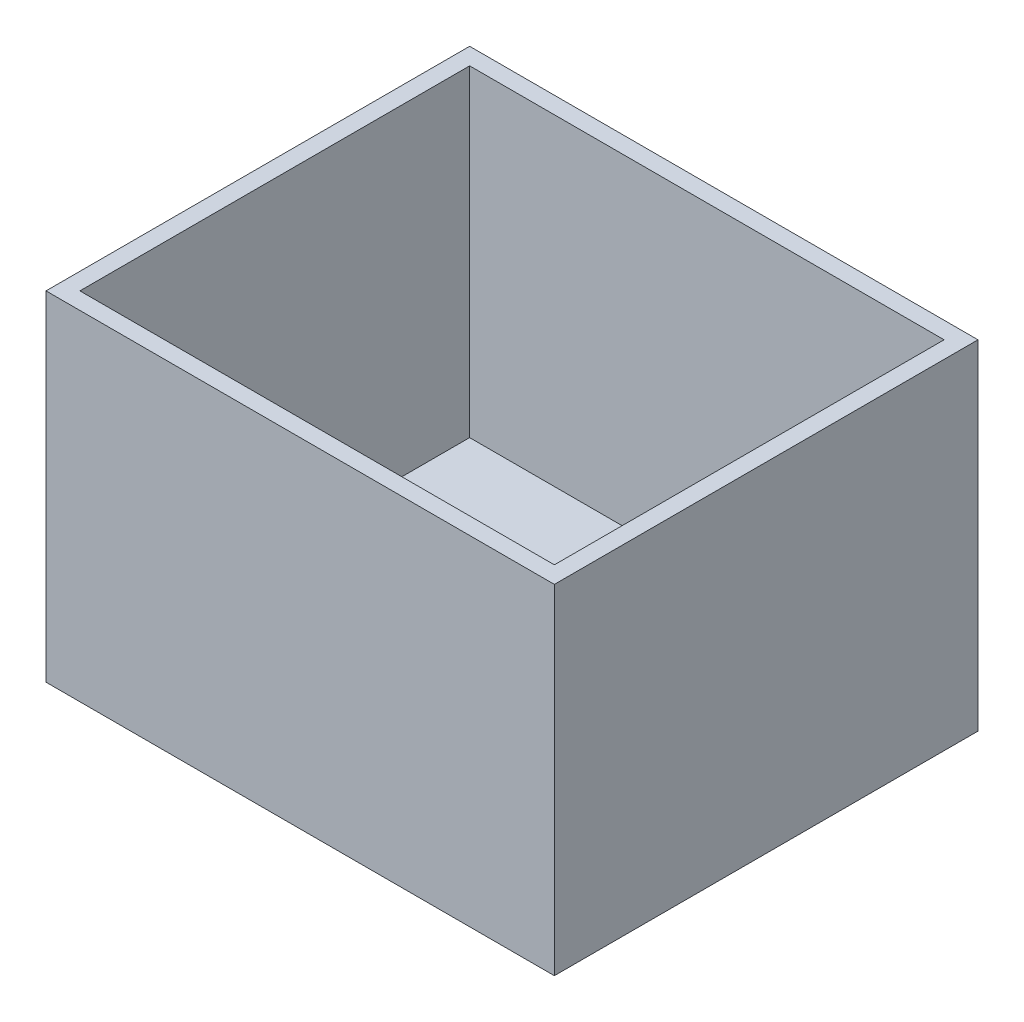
ISO-10303-21;
HEADER;
FILE_DESCRIPTION(('STEP AP214'),'2;1');
FILE_NAME('part.step','',(''),(''),'','','');
FILE_SCHEMA(('AUTOMOTIVE_DESIGN { 1 0 10303 214 1 1 1 1 }'));
ENDSEC;
DATA;
#1=APPLICATION_CONTEXT('core data for automotive mechanical design processes');
#2=APPLICATION_PROTOCOL_DEFINITION('international standard','automotive_design',2000,#1);
#3=PRODUCT_CONTEXT('',#1,'mechanical');
#4=PRODUCT('Part','Part','',(#3));
#5=PRODUCT_RELATED_PRODUCT_CATEGORY('part','',(#4));
#6=PRODUCT_DEFINITION_FORMATION('','',#4);
#7=PRODUCT_DEFINITION_CONTEXT('part definition',#1,'design');
#8=PRODUCT_DEFINITION('design','',#6,#7);
#9=PRODUCT_DEFINITION_SHAPE('','',#8);
#10=(LENGTH_UNIT() NAMED_UNIT(*) SI_UNIT(.MILLI.,.METRE.));
#11=(NAMED_UNIT(*) PLANE_ANGLE_UNIT() SI_UNIT($,.RADIAN.));
#12=(NAMED_UNIT(*) SI_UNIT($,.STERADIAN.) SOLID_ANGLE_UNIT());
#13=UNCERTAINTY_MEASURE_WITH_UNIT(LENGTH_MEASURE(1.E-05),#10,'distance_accuracy_value','');
#14=(GEOMETRIC_REPRESENTATION_CONTEXT(3) GLOBAL_UNCERTAINTY_ASSIGNED_CONTEXT((#13)) GLOBAL_UNIT_ASSIGNED_CONTEXT((#10,
#11,#12)) REPRESENTATION_CONTEXT('',''));
#15=CARTESIAN_POINT('',(0.,0.,0.));
#16=DIRECTION('',(0.,0.,1.));
#17=DIRECTION('',(1.,0.,0.));
#18=AXIS2_PLACEMENT_3D('',#15,#16,#17);
#19=CARTESIAN_POINT('',(0.,0.,25.));
#20=DIRECTION('',(0.,1.,0.));
#21=DIRECTION('',(0.,0.,1.));
#22=AXIS2_PLACEMENT_3D('',#19,#20,#21);
#23=PLANE('',#22);
#24=DIRECTION('',(1.,0.,0.));
#25=VECTOR('',#24,1.);
#26=CARTESIAN_POINT('',(0.,0.,-25.));
#27=LINE('',#26,#25);
#28=CARTESIAN_POINT('',(0.,0.,-25.));
#29=VERTEX_POINT('',#28);
#30=CARTESIAN_POINT('',(60.,0.,-25.));
#31=VERTEX_POINT('',#30);
#32=EDGE_CURVE('E164',#29,#31,#27,.T.);
#33=ORIENTED_EDGE('',*,*,#32,.T.);
#34=DIRECTION('',(0.,0.,-1.));
#35=VECTOR('',#34,1.);
#36=CARTESIAN_POINT('',(60.,0.,25.));
#37=LINE('',#36,#35);
#38=CARTESIAN_POINT('',(60.,0.,25.));
#39=VERTEX_POINT('',#38);
#40=EDGE_CURVE('E172',#39,#31,#37,.T.);
#41=ORIENTED_EDGE('',*,*,#40,.F.);
#42=DIRECTION('',(1.,0.,0.));
#43=VECTOR('',#42,1.);
#44=CARTESIAN_POINT('',(0.,0.,25.));
#45=LINE('',#44,#43);
#46=CARTESIAN_POINT('',(0.,0.,25.));
#47=VERTEX_POINT('',#46);
#48=EDGE_CURVE('E94',#47,#39,#45,.T.);
#49=ORIENTED_EDGE('',*,*,#48,.F.);
#50=DIRECTION('',(0.,0.,-1.));
#51=VECTOR('',#50,1.);
#52=CARTESIAN_POINT('',(0.,0.,25.));
#53=LINE('',#52,#51);
#54=EDGE_CURVE('E175',#47,#29,#53,.T.);
#55=ORIENTED_EDGE('',*,*,#54,.T.);
#56=EDGE_LOOP('',(#33,#41,#49,#55));
#57=FACE_BOUND('',#56,.T.);
#58=CARTESIAN_POINT('',(6.,0.,18.));
#59=DIRECTION('',(0.,1.,0.));
#60=DIRECTION('',(0.,0.,1.));
#61=AXIS2_PLACEMENT_3D('',#58,#59,#60);
#62=CIRCLE('',#61,2.5);
#63=CARTESIAN_POINT('',(6.,0.,20.5));
#64=VERTEX_POINT('',#63);
#65=EDGE_CURVE('E177',#64,#64,#62,.F.);
#66=ORIENTED_EDGE('',*,*,#65,.F.);
#67=EDGE_LOOP('',(#66));
#68=FACE_BOUND('',#67,.T.);
#69=CARTESIAN_POINT('',(6.,0.,-18.));
#70=DIRECTION('',(0.,1.,0.));
#71=DIRECTION('',(0.,0.,1.));
#72=AXIS2_PLACEMENT_3D('',#69,#70,#71);
#73=CIRCLE('',#72,2.5);
#74=CARTESIAN_POINT('',(6.,0.,-15.5));
#75=VERTEX_POINT('',#74);
#76=EDGE_CURVE('E49',#75,#75,#73,.F.);
#77=ORIENTED_EDGE('',*,*,#76,.F.);
#78=EDGE_LOOP('',(#77));
#79=FACE_BOUND('',#78,.T.);
#80=CARTESIAN_POINT('',(55.,0.,0.));
#81=DIRECTION('',(0.,1.,0.));
#82=DIRECTION('',(0.,0.,1.));
#83=AXIS2_PLACEMENT_3D('',#80,#81,#82);
#84=CIRCLE('',#83,2.5);
#85=CARTESIAN_POINT('',(55.,0.,2.5));
#86=VERTEX_POINT('',#85);
#87=EDGE_CURVE('E11',#86,#86,#84,.F.);
#88=ORIENTED_EDGE('',*,*,#87,.F.);
#89=EDGE_LOOP('',(#88));
#90=FACE_BOUND('',#89,.T.);
#91=ADVANCED_FACE('F40',(#57,#68,#79,#90),#23,.F.);
#92=ORIENTED_EDGE('',*,*,#87,.T.);
#93=EDGE_LOOP('',(#92));
#94=FACE_BOUND('',#93,.T.);
#95=ADVANCED_FACE('F190',(#94),#23,.F.);
#96=ORIENTED_EDGE('',*,*,#76,.T.);
#97=EDGE_LOOP('',(#96));
#98=FACE_BOUND('',#97,.T.);
#99=ADVANCED_FACE('F186',(#98),#23,.F.);
#100=CARTESIAN_POINT('',(0.,0.,25.));
#101=DIRECTION('',(1.,0.,0.));
#102=DIRECTION('',(0.,0.,-1.));
#103=AXIS2_PLACEMENT_3D('',#100,#101,#102);
#104=PLANE('',#103);
#105=DIRECTION('',(0.,-1.,0.));
#106=VECTOR('',#105,1.);
#107=CARTESIAN_POINT('',(0.,0.,-25.));
#108=LINE('',#107,#106);
#109=CARTESIAN_POINT('',(0.,40.,-25.));
#110=VERTEX_POINT('',#109);
#111=EDGE_CURVE('E151',#110,#29,#108,.T.);
#112=ORIENTED_EDGE('',*,*,#111,.T.);
#113=ORIENTED_EDGE('',*,*,#54,.F.);
#114=DIRECTION('',(0.,-1.,0.));
#115=VECTOR('',#114,1.);
#116=CARTESIAN_POINT('',(0.,0.,25.));
#117=LINE('',#116,#115);
#118=CARTESIAN_POINT('',(0.,40.,25.));
#119=VERTEX_POINT('',#118);
#120=EDGE_CURVE('E155',#119,#47,#117,.T.);
#121=ORIENTED_EDGE('',*,*,#120,.F.);
#122=DIRECTION('',(0.,0.,-1.));
#123=VECTOR('',#122,1.);
#124=CARTESIAN_POINT('',(0.,40.,25.));
#125=LINE('',#124,#123);
#126=EDGE_CURVE('E161',#119,#110,#125,.T.);
#127=ORIENTED_EDGE('',*,*,#126,.T.);
#128=EDGE_LOOP('',(#112,#113,#121,#127));
#129=FACE_BOUND('',#128,.T.);
#130=ADVANCED_FACE('F42',(#129),#104,.F.);
#131=ORIENTED_EDGE('',*,*,#65,.T.);
#132=EDGE_LOOP('',(#131));
#133=FACE_BOUND('',#132,.T.);
#134=ADVANCED_FACE('F191',(#133),#23,.F.);
#135=CARTESIAN_POINT('',(60.,0.,25.));
#136=DIRECTION('',(-1.,0.,0.));
#137=DIRECTION('',(0.,-1.,0.));
#138=AXIS2_PLACEMENT_3D('',#135,#136,#137);
#139=PLANE('',#138);
#140=DIRECTION('',(0.,1.,0.));
#141=VECTOR('',#140,1.);
#142=CARTESIAN_POINT('',(60.,0.,-25.));
#143=LINE('',#142,#141);
#144=CARTESIAN_POINT('',(60.,40.,-25.));
#145=VERTEX_POINT('',#144);
#146=EDGE_CURVE('E166',#31,#145,#143,.T.);
#147=ORIENTED_EDGE('',*,*,#146,.T.);
#148=DIRECTION('',(0.,0.,-1.));
#149=VECTOR('',#148,1.);
#150=CARTESIAN_POINT('',(60.,40.,25.));
#151=LINE('',#150,#149);
#152=CARTESIAN_POINT('',(60.,40.,25.));
#153=VERTEX_POINT('',#152);
#154=EDGE_CURVE('E170',#153,#145,#151,.T.);
#155=ORIENTED_EDGE('',*,*,#154,.F.);
#156=DIRECTION('',(0.,1.,0.));
#157=VECTOR('',#156,1.);
#158=CARTESIAN_POINT('',(60.,0.,25.));
#159=LINE('',#158,#157);
#160=EDGE_CURVE('E158',#39,#153,#159,.T.);
#161=ORIENTED_EDGE('',*,*,#160,.F.);
#162=ORIENTED_EDGE('',*,*,#40,.T.);
#163=EDGE_LOOP('',(#147,#155,#161,#162));
#164=FACE_BOUND('',#163,.T.);
#165=ADVANCED_FACE('F200',(#164),#139,.F.);
#166=CARTESIAN_POINT('',(0.,40.,25.));
#167=DIRECTION('',(0.,-1.,0.));
#168=DIRECTION('',(0.,0.,-1.));
#169=AXIS2_PLACEMENT_3D('',#166,#167,#168);
#170=PLANE('',#169);
#171=DIRECTION('',(-1.,0.,0.));
#172=VECTOR('',#171,1.);
#173=CARTESIAN_POINT('',(58.,40.,-23.));
#174=LINE('',#173,#172);
#175=CARTESIAN_POINT('',(58.,40.,-23.));
#176=VERTEX_POINT('',#175);
#177=CARTESIAN_POINT('',(2.,40.,-23.));
#178=VERTEX_POINT('',#177);
#179=EDGE_CURVE('E145',#176,#178,#174,.T.);
#180=ORIENTED_EDGE('',*,*,#179,.F.);
#181=DIRECTION('',(0.,0.,-1.));
#182=VECTOR('',#181,1.);
#183=CARTESIAN_POINT('',(58.,40.,23.));
#184=LINE('',#183,#182);
#185=CARTESIAN_POINT('',(58.,40.,23.));
#186=VERTEX_POINT('',#185);
#187=EDGE_CURVE('E56',#186,#176,#184,.T.);
#188=ORIENTED_EDGE('',*,*,#187,.F.);
#189=DIRECTION('',(1.,0.,0.));
#190=VECTOR('',#189,1.);
#191=CARTESIAN_POINT('',(2.,40.,23.));
#192=LINE('',#191,#190);
#193=CARTESIAN_POINT('',(2.,40.,23.));
#194=VERTEX_POINT('',#193);
#195=EDGE_CURVE('E136',#194,#186,#192,.T.);
#196=ORIENTED_EDGE('',*,*,#195,.F.);
#197=DIRECTION('',(0.,0.,1.));
#198=VECTOR('',#197,1.);
#199=CARTESIAN_POINT('',(2.,40.,-23.));
#200=LINE('',#199,#198);
#201=EDGE_CURVE('E139',#178,#194,#200,.T.);
#202=ORIENTED_EDGE('',*,*,#201,.F.);
#203=EDGE_LOOP('',(#180,#188,#196,#202));
#204=FACE_BOUND('',#203,.T.);
#205=DIRECTION('',(-1.,0.,0.));
#206=VECTOR('',#205,1.);
#207=CARTESIAN_POINT('',(0.,40.,-25.));
#208=LINE('',#207,#206);
#209=EDGE_CURVE('E86',#145,#110,#208,.T.);
#210=ORIENTED_EDGE('',*,*,#209,.T.);
#211=ORIENTED_EDGE('',*,*,#126,.F.);
#212=DIRECTION('',(-1.,0.,0.));
#213=VECTOR('',#212,1.);
#214=CARTESIAN_POINT('',(0.,40.,25.));
#215=LINE('',#214,#213);
#216=EDGE_CURVE('E65',#153,#119,#215,.T.);
#217=ORIENTED_EDGE('',*,*,#216,.F.);
#218=ORIENTED_EDGE('',*,*,#154,.T.);
#219=EDGE_LOOP('',(#210,#211,#217,#218));
#220=FACE_BOUND('',#219,.T.);
#221=ADVANCED_FACE('F204',(#204,#220),#170,.F.);
#222=CARTESIAN_POINT('',(0.,40.,25.));
#223=DIRECTION('',(0.,0.,-1.));
#224=DIRECTION('',(-1.,0.,0.));
#225=AXIS2_PLACEMENT_3D('',#222,#223,#224);
#226=PLANE('',#225);
#227=ORIENTED_EDGE('',*,*,#120,.T.);
#228=ORIENTED_EDGE('',*,*,#48,.T.);
#229=ORIENTED_EDGE('',*,*,#160,.T.);
#230=ORIENTED_EDGE('',*,*,#216,.T.);
#231=EDGE_LOOP('',(#227,#228,#229,#230));
#232=FACE_BOUND('',#231,.T.);
#233=ADVANCED_FACE('F208',(#232),#226,.F.);
#234=CARTESIAN_POINT('',(0.,40.,-25.));
#235=DIRECTION('',(0.,0.,-1.));
#236=DIRECTION('',(-1.,0.,0.));
#237=AXIS2_PLACEMENT_3D('',#234,#235,#236);
#238=PLANE('',#237);
#239=ORIENTED_EDGE('',*,*,#111,.F.);
#240=ORIENTED_EDGE('',*,*,#209,.F.);
#241=ORIENTED_EDGE('',*,*,#146,.F.);
#242=ORIENTED_EDGE('',*,*,#32,.F.);
#243=EDGE_LOOP('',(#239,#240,#241,#242));
#244=FACE_BOUND('',#243,.T.);
#245=ADVANCED_FACE('F210',(#244),#238,.T.);
#246=CARTESIAN_POINT('',(58.,2.,23.));
#247=DIRECTION('',(1.,0.,0.));
#248=DIRECTION('',(0.,0.,-1.));
#249=AXIS2_PLACEMENT_3D('',#246,#247,#248);
#250=PLANE('',#249);
#251=ORIENTED_EDGE('',*,*,#187,.T.);
#252=DIRECTION('',(0.,1.,0.));
#253=VECTOR('',#252,1.);
#254=CARTESIAN_POINT('',(58.,2.,-23.));
#255=LINE('',#254,#253);
#256=CARTESIAN_POINT('',(58.,2.,-23.));
#257=VERTEX_POINT('',#256);
#258=EDGE_CURVE('E114',#257,#176,#255,.T.);
#259=ORIENTED_EDGE('',*,*,#258,.F.);
#260=DIRECTION('',(0.,0.,-1.));
#261=VECTOR('',#260,1.);
#262=CARTESIAN_POINT('',(58.,2.,23.));
#263=LINE('',#262,#261);
#264=CARTESIAN_POINT('',(58.,2.,23.));
#265=VERTEX_POINT('',#264);
#266=EDGE_CURVE('E118',#265,#257,#263,.T.);
#267=ORIENTED_EDGE('',*,*,#266,.F.);
#268=DIRECTION('',(0.,1.,0.));
#269=VECTOR('',#268,1.);
#270=CARTESIAN_POINT('',(58.,2.,23.));
#271=LINE('',#270,#269);
#272=EDGE_CURVE('E149',#265,#186,#271,.T.);
#273=ORIENTED_EDGE('',*,*,#272,.T.);
#274=EDGE_LOOP('',(#251,#259,#267,#273));
#275=FACE_BOUND('',#274,.T.);
#276=ADVANCED_FACE('F116',(#275),#250,.F.);
#277=CARTESIAN_POINT('',(2.,2.,23.));
#278=DIRECTION('',(0.,0.,1.));
#279=DIRECTION('',(1.,0.,0.));
#280=AXIS2_PLACEMENT_3D('',#277,#278,#279);
#281=PLANE('',#280);
#282=ORIENTED_EDGE('',*,*,#195,.T.);
#283=ORIENTED_EDGE('',*,*,#272,.F.);
#284=DIRECTION('',(1.,0.,0.));
#285=VECTOR('',#284,1.);
#286=CARTESIAN_POINT('',(2.,2.,23.));
#287=LINE('',#286,#285);
#288=CARTESIAN_POINT('',(2.,2.,23.));
#289=VERTEX_POINT('',#288);
#290=EDGE_CURVE('E124',#289,#265,#287,.T.);
#291=ORIENTED_EDGE('',*,*,#290,.F.);
#292=DIRECTION('',(0.,1.,0.));
#293=VECTOR('',#292,1.);
#294=CARTESIAN_POINT('',(2.,2.,23.));
#295=LINE('',#294,#293);
#296=EDGE_CURVE('E152',#289,#194,#295,.T.);
#297=ORIENTED_EDGE('',*,*,#296,.T.);
#298=EDGE_LOOP('',(#282,#283,#291,#297));
#299=FACE_BOUND('',#298,.T.);
#300=ADVANCED_FACE('F218',(#299),#281,.F.);
#301=CARTESIAN_POINT('',(2.,2.,-23.));
#302=DIRECTION('',(-1.,0.,0.));
#303=DIRECTION('',(0.,0.,1.));
#304=AXIS2_PLACEMENT_3D('',#301,#302,#303);
#305=PLANE('',#304);
#306=ORIENTED_EDGE('',*,*,#201,.T.);
#307=ORIENTED_EDGE('',*,*,#296,.F.);
#308=DIRECTION('',(0.,0.,1.));
#309=VECTOR('',#308,1.);
#310=CARTESIAN_POINT('',(2.,2.,-23.));
#311=LINE('',#310,#309);
#312=CARTESIAN_POINT('',(2.,2.,-23.));
#313=VERTEX_POINT('',#312);
#314=EDGE_CURVE('E132',#313,#289,#311,.T.);
#315=ORIENTED_EDGE('',*,*,#314,.F.);
#316=DIRECTION('',(0.,1.,0.));
#317=VECTOR('',#316,1.);
#318=CARTESIAN_POINT('',(2.,2.,-23.));
#319=LINE('',#318,#317);
#320=EDGE_CURVE('E123',#313,#178,#319,.T.);
#321=ORIENTED_EDGE('',*,*,#320,.T.);
#322=EDGE_LOOP('',(#306,#307,#315,#321));
#323=FACE_BOUND('',#322,.T.);
#324=ADVANCED_FACE('F221',(#323),#305,.F.);
#325=CARTESIAN_POINT('',(58.,2.,-23.));
#326=DIRECTION('',(0.,0.,-1.));
#327=DIRECTION('',(-1.,0.,0.));
#328=AXIS2_PLACEMENT_3D('',#325,#326,#327);
#329=PLANE('',#328);
#330=ORIENTED_EDGE('',*,*,#179,.T.);
#331=ORIENTED_EDGE('',*,*,#320,.F.);
#332=DIRECTION('',(-1.,0.,0.));
#333=VECTOR('',#332,1.);
#334=CARTESIAN_POINT('',(58.,2.,-23.));
#335=LINE('',#334,#333);
#336=EDGE_CURVE('E127',#257,#313,#335,.T.);
#337=ORIENTED_EDGE('',*,*,#336,.F.);
#338=ORIENTED_EDGE('',*,*,#258,.T.);
#339=EDGE_LOOP('',(#330,#331,#337,#338));
#340=FACE_BOUND('',#339,.T.);
#341=ADVANCED_FACE('F128',(#340),#329,.F.);
#342=CARTESIAN_POINT('',(0.,2.,0.));
#343=DIRECTION('',(0.,1.,0.));
#344=DIRECTION('',(0.,0.,1.));
#345=AXIS2_PLACEMENT_3D('',#342,#343,#344);
#346=PLANE('',#345);
#347=ORIENTED_EDGE('',*,*,#266,.T.);
#348=ORIENTED_EDGE('',*,*,#336,.T.);
#349=ORIENTED_EDGE('',*,*,#314,.T.);
#350=ORIENTED_EDGE('',*,*,#290,.T.);
#351=EDGE_LOOP('',(#347,#348,#349,#350));
#352=FACE_BOUND('',#351,.T.);
#353=ADVANCED_FACE('F134',(#352),#346,.T.);
#354=CLOSED_SHELL('',(#91,#95,#99,#130,#134,#165,#221,#233,#245,#276,#300,#324,#341,#353));
#355=MANIFOLD_SOLID_BREP('B2',#354);
#356=ADVANCED_BREP_SHAPE_REPRESENTATION('',(#18,#355),#14);
#357=SHAPE_DEFINITION_REPRESENTATION(#9,#356);
ENDSEC;
END-ISO-10303-21;
